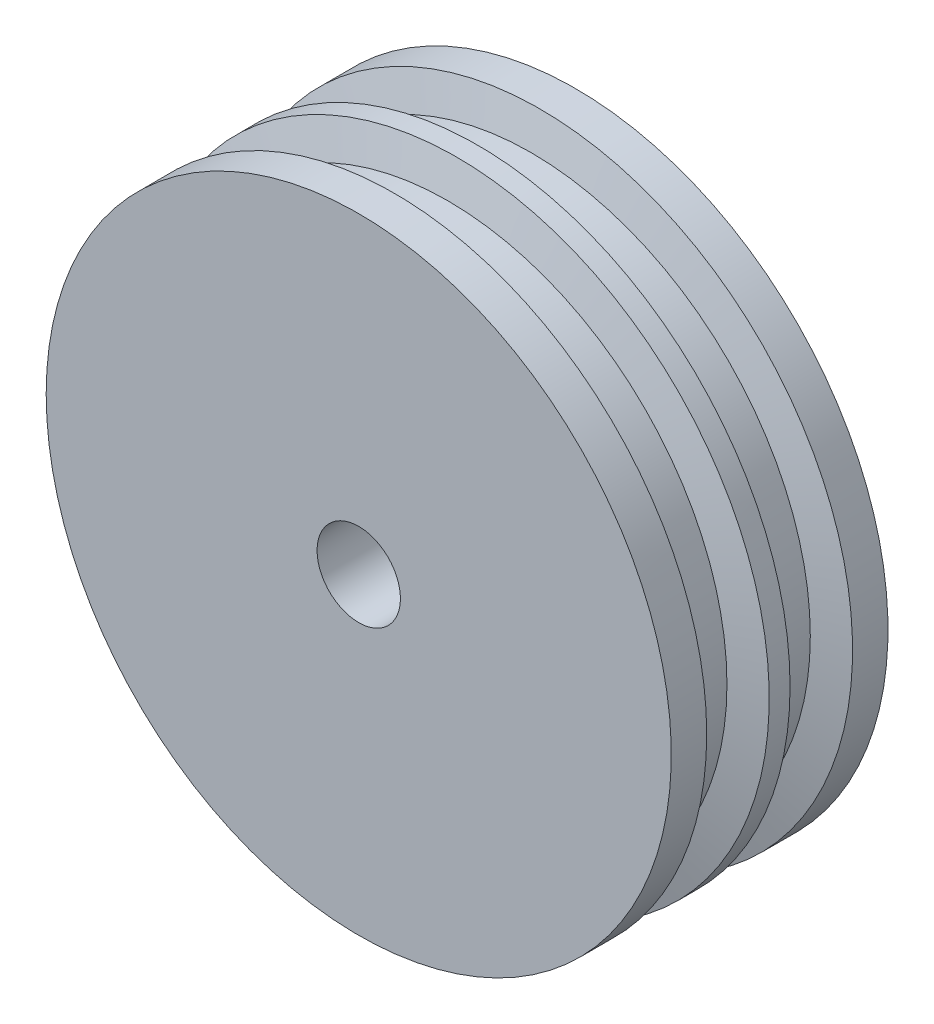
ISO-10303-21;
HEADER;
FILE_DESCRIPTION(('STEP AP214'),'2;1');
FILE_NAME('part.step','',(''),(''),'','','');
FILE_SCHEMA(('AUTOMOTIVE_DESIGN { 1 0 10303 214 1 1 1 1 }'));
ENDSEC;
DATA;
#1=APPLICATION_CONTEXT('core data for automotive mechanical design processes');
#2=APPLICATION_PROTOCOL_DEFINITION('international standard','automotive_design',2000,#1);
#3=PRODUCT_CONTEXT('',#1,'mechanical');
#4=PRODUCT('Part','Part','',(#3));
#5=PRODUCT_RELATED_PRODUCT_CATEGORY('part','',(#4));
#6=PRODUCT_DEFINITION_FORMATION('','',#4);
#7=PRODUCT_DEFINITION_CONTEXT('part definition',#1,'design');
#8=PRODUCT_DEFINITION('design','',#6,#7);
#9=PRODUCT_DEFINITION_SHAPE('','',#8);
#10=(LENGTH_UNIT() NAMED_UNIT(*) SI_UNIT(.MILLI.,.METRE.));
#11=(NAMED_UNIT(*) PLANE_ANGLE_UNIT() SI_UNIT($,.RADIAN.));
#12=(NAMED_UNIT(*) SI_UNIT($,.STERADIAN.) SOLID_ANGLE_UNIT());
#13=UNCERTAINTY_MEASURE_WITH_UNIT(LENGTH_MEASURE(1.E-05),#10,'distance_accuracy_value','');
#14=(GEOMETRIC_REPRESENTATION_CONTEXT(3) GLOBAL_UNCERTAINTY_ASSIGNED_CONTEXT((#13)) GLOBAL_UNIT_ASSIGNED_CONTEXT((#10,
#11,#12)) REPRESENTATION_CONTEXT('',''));
#15=CARTESIAN_POINT('',(0.,0.,0.));
#16=DIRECTION('',(0.,0.,1.));
#17=DIRECTION('',(1.,0.,0.));
#18=AXIS2_PLACEMENT_3D('',#15,#16,#17);
#19=CARTESIAN_POINT('',(0.,0.,26.));
#20=DIRECTION('',(0.,0.,-1.));
#21=DIRECTION('',(-1.,0.,0.));
#22=AXIS2_PLACEMENT_3D('',#19,#20,#21);
#23=CYLINDRICAL_SURFACE('',#22,75.);
#24=CARTESIAN_POINT('',(0.,0.,2.5));
#25=DIRECTION('',(0.,0.,1.));
#26=DIRECTION('',(1.,0.,0.));
#27=AXIS2_PLACEMENT_3D('',#24,#25,#26);
#28=CIRCLE('',#27,75.);
#29=CARTESIAN_POINT('',(-75.,0.,2.5));
#30=VERTEX_POINT('',#29);
#31=EDGE_CURVE('E47',#30,#30,#28,.T.);
#32=CARTESIAN_POINT('',(0.,0.,-2.49999999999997));
#33=DIRECTION('',(0.,0.,1.));
#34=DIRECTION('',(1.,0.,0.));
#35=AXIS2_PLACEMENT_3D('',#32,#33,#34);
#36=CIRCLE('',#35,75.);
#37=CARTESIAN_POINT('',(-75.,0.,-2.49999999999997));
#38=VERTEX_POINT('',#37);
#39=EDGE_CURVE('E56',#38,#38,#36,.T.);
#40=CARTESIAN_POINT('',(-75.,0.,2.5));
#41=CARTESIAN_POINT('',(-75.,0.,2.44791666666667));
#42=CARTESIAN_POINT('',(-75.,0.,2.39583333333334));
#43=CARTESIAN_POINT('',(-75.,0.,2.29166666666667));
#44=CARTESIAN_POINT('',(-75.,0.,2.23958333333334));
#45=CARTESIAN_POINT('',(-75.,0.,2.13541666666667));
#46=CARTESIAN_POINT('',(-75.,0.,2.08333333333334));
#47=CARTESIAN_POINT('',(-75.,0.,1.97916666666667));
#48=CARTESIAN_POINT('',(-75.,0.,1.92708333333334));
#49=CARTESIAN_POINT('',(-75.,0.,1.82291666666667));
#50=CARTESIAN_POINT('',(-75.,0.,1.77083333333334));
#51=CARTESIAN_POINT('',(-75.,0.,1.66666666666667));
#52=CARTESIAN_POINT('',(-75.,0.,1.61458333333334));
#53=CARTESIAN_POINT('',(-75.,0.,1.51041666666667));
#54=CARTESIAN_POINT('',(-75.,0.,1.45833333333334));
#55=CARTESIAN_POINT('',(-75.,0.,1.35416666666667));
#56=CARTESIAN_POINT('',(-75.,0.,1.30208333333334));
#57=CARTESIAN_POINT('',(-75.,0.,1.19791666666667));
#58=CARTESIAN_POINT('',(-75.,0.,1.14583333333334));
#59=CARTESIAN_POINT('',(-75.,0.,1.04166666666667));
#60=CARTESIAN_POINT('',(-75.,0.,0.989583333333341));
#61=CARTESIAN_POINT('',(-75.,0.,0.885416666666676));
#62=CARTESIAN_POINT('',(-75.,0.,0.833333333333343));
#63=CARTESIAN_POINT('',(-75.,0.,0.729166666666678));
#64=CARTESIAN_POINT('',(-75.,0.,0.677083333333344));
#65=CARTESIAN_POINT('',(-75.,0.,0.572916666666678));
#66=CARTESIAN_POINT('',(-75.,0.,0.520833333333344));
#67=CARTESIAN_POINT('',(-75.,0.,0.416666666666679));
#68=CARTESIAN_POINT('',(-75.,0.,0.364583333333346));
#69=CARTESIAN_POINT('',(-75.,0.,0.260416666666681));
#70=CARTESIAN_POINT('',(-75.,0.,0.208333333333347));
#71=CARTESIAN_POINT('',(-75.,0.,0.104166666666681));
#72=CARTESIAN_POINT('',(-75.,0.,0.0520833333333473));
#73=CARTESIAN_POINT('',(-75.,0.,-0.0520833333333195));
#74=CARTESIAN_POINT('',(-75.,0.,-0.104166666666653));
#75=CARTESIAN_POINT('',(-75.,0.,-0.20833333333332));
#76=CARTESIAN_POINT('',(-75.,0.,-0.260416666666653));
#77=CARTESIAN_POINT('',(-75.,0.,-0.364583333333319));
#78=CARTESIAN_POINT('',(-75.,0.,-0.416666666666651));
#79=CARTESIAN_POINT('',(-75.,0.,-0.520833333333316));
#80=CARTESIAN_POINT('',(-75.,0.,-0.57291666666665));
#81=CARTESIAN_POINT('',(-75.,0.,-0.677083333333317));
#82=CARTESIAN_POINT('',(-75.,0.,-0.72916666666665));
#83=CARTESIAN_POINT('',(-75.,0.,-0.833333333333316));
#84=CARTESIAN_POINT('',(-75.,0.,-0.885416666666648));
#85=CARTESIAN_POINT('',(-75.,0.,-0.989583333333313));
#86=CARTESIAN_POINT('',(-75.,0.,-1.04166666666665));
#87=CARTESIAN_POINT('',(-75.,0.,-1.14583333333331));
#88=CARTESIAN_POINT('',(-75.,0.,-1.19791666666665));
#89=CARTESIAN_POINT('',(-75.,0.,-1.30208333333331));
#90=CARTESIAN_POINT('',(-75.,0.,-1.35416666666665));
#91=CARTESIAN_POINT('',(-75.,0.,-1.45833333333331));
#92=CARTESIAN_POINT('',(-75.,0.,-1.51041666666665));
#93=CARTESIAN_POINT('',(-75.,0.,-1.61458333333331));
#94=CARTESIAN_POINT('',(-75.,0.,-1.66666666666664));
#95=CARTESIAN_POINT('',(-75.,0.,-1.77083333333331));
#96=CARTESIAN_POINT('',(-75.,0.,-1.82291666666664));
#97=CARTESIAN_POINT('',(-75.,0.,-1.92708333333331));
#98=CARTESIAN_POINT('',(-75.,0.,-1.97916666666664));
#99=CARTESIAN_POINT('',(-75.,0.,-2.08333333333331));
#100=CARTESIAN_POINT('',(-75.,0.,-2.13541666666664));
#101=CARTESIAN_POINT('',(-75.,0.,-2.23958333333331));
#102=CARTESIAN_POINT('',(-75.,0.,-2.29166666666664));
#103=CARTESIAN_POINT('',(-75.,0.,-2.39583333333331));
#104=CARTESIAN_POINT('',(-75.,0.,-2.44791666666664));
#105=CARTESIAN_POINT('',(-75.,0.,-2.49999999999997));
#106=B_SPLINE_CURVE_WITH_KNOTS('',3,(#40,#41,#42,#43,#44,#45,#46,#47,#48,#49,#50,#51,#52,#53,
#54,#55,#56,#57,#58,#59,#60,#61,#62,#63,#64,#65,#66,#67,#68,#69,#70,#71,#72,#73,#74,#75,#76,#77,
#78,#79,#80,#81,#82,#83,#84,#85,#86,#87,#88,#89,#90,#91,#92,#93,#94,#95,#96,#97,#98,#99,#100,
#101,#102,#103,#104,#105),.UNSPECIFIED.,.F.,.F.,(4,2,2,2,2,2,2,2,2,2,2,2,2,2,2,2,2,2,2,2,2,2,2,
2,2,2,2,2,2,2,2,2,4),(0.,0.15625,0.3125,0.468749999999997,0.624999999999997,0.781249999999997,
0.937499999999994,1.09374999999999,1.24999999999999,1.40624999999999,1.56249999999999,
1.71874999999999,1.87499999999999,2.03124999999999,2.18749999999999,2.34374999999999,
2.49999999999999,2.65624999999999,2.81249999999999,2.96874999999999,3.12499999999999,
3.28124999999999,3.43749999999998,3.59374999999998,3.74999999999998,3.90624999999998,
4.06249999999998,4.21874999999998,4.37499999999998,4.53124999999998,4.68749999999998,
4.84374999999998,4.99999999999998),.UNSPECIFIED.);
#107=EDGE_CURVE('BSEAM24',#30,#38,#106,.T.);
#108=ORIENTED_EDGE('',*,*,#31,.F.);
#109=ORIENTED_EDGE('',*,*,#39,.T.);
#110=ORIENTED_EDGE('',*,*,#107,.T.);
#111=ORIENTED_EDGE('',*,*,#107,.F.);
#112=EDGE_LOOP('',(#108,#110,#109,#111));
#113=FACE_BOUND('',#112,.T.);
#114=ADVANCED_FACE('F24',(#113),#23,.T.);
#115=CARTESIAN_POINT('',(0.,0.,-26.));
#116=DIRECTION('',(0.,0.,1.));
#117=DIRECTION('',(1.,0.,0.));
#118=AXIS2_PLACEMENT_3D('',#115,#116,#117);
#119=CIRCLE('',#118,75.);
#120=CARTESIAN_POINT('',(-75.,0.,-26.));
#121=VERTEX_POINT('',#120);
#122=EDGE_CURVE('E31',#121,#121,#119,.T.);
#123=CARTESIAN_POINT('',(0.,0.,-17.5));
#124=DIRECTION('',(0.,0.,1.));
#125=DIRECTION('',(1.,0.,0.));
#126=AXIS2_PLACEMENT_3D('',#123,#124,#125);
#127=CIRCLE('',#126,75.);
#128=CARTESIAN_POINT('',(-75.,0.,-17.5));
#129=VERTEX_POINT('',#128);
#130=EDGE_CURVE('E59',#129,#129,#127,.T.);
#131=CARTESIAN_POINT('',(-75.,0.,-26.));
#132=CARTESIAN_POINT('',(-75.,0.,-25.9114583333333));
#133=CARTESIAN_POINT('',(-75.,0.,-25.8229166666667));
#134=CARTESIAN_POINT('',(-75.,0.,-25.6458333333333));
#135=CARTESIAN_POINT('',(-75.,0.,-25.5572916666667));
#136=CARTESIAN_POINT('',(-75.,0.,-25.3802083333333));
#137=CARTESIAN_POINT('',(-75.,0.,-25.2916666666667));
#138=CARTESIAN_POINT('',(-75.,0.,-25.1145833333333));
#139=CARTESIAN_POINT('',(-75.,0.,-25.0260416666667));
#140=CARTESIAN_POINT('',(-75.,0.,-24.8489583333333));
#141=CARTESIAN_POINT('',(-75.,0.,-24.7604166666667));
#142=CARTESIAN_POINT('',(-75.,0.,-24.5833333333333));
#143=CARTESIAN_POINT('',(-75.,0.,-24.4947916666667));
#144=CARTESIAN_POINT('',(-75.,0.,-24.3177083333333));
#145=CARTESIAN_POINT('',(-75.,0.,-24.2291666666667));
#146=CARTESIAN_POINT('',(-75.,0.,-24.0520833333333));
#147=CARTESIAN_POINT('',(-75.,0.,-23.9635416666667));
#148=CARTESIAN_POINT('',(-75.,0.,-23.7864583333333));
#149=CARTESIAN_POINT('',(-75.,0.,-23.6979166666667));
#150=CARTESIAN_POINT('',(-75.,0.,-23.5208333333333));
#151=CARTESIAN_POINT('',(-75.,0.,-23.4322916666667));
#152=CARTESIAN_POINT('',(-75.,0.,-23.2552083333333));
#153=CARTESIAN_POINT('',(-75.,0.,-23.1666666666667));
#154=CARTESIAN_POINT('',(-75.,0.,-22.9895833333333));
#155=CARTESIAN_POINT('',(-75.,0.,-22.9010416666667));
#156=CARTESIAN_POINT('',(-75.,0.,-22.7239583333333));
#157=CARTESIAN_POINT('',(-75.,0.,-22.6354166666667));
#158=CARTESIAN_POINT('',(-75.,0.,-22.4583333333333));
#159=CARTESIAN_POINT('',(-75.,0.,-22.3697916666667));
#160=CARTESIAN_POINT('',(-75.,0.,-22.1927083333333));
#161=CARTESIAN_POINT('',(-75.,0.,-22.1041666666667));
#162=CARTESIAN_POINT('',(-75.,0.,-21.9270833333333));
#163=CARTESIAN_POINT('',(-75.,0.,-21.8385416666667));
#164=CARTESIAN_POINT('',(-75.,0.,-21.6614583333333));
#165=CARTESIAN_POINT('',(-75.,0.,-21.5729166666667));
#166=CARTESIAN_POINT('',(-75.,0.,-21.3958333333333));
#167=CARTESIAN_POINT('',(-75.,0.,-21.3072916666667));
#168=CARTESIAN_POINT('',(-75.,0.,-21.1302083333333));
#169=CARTESIAN_POINT('',(-75.,0.,-21.0416666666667));
#170=CARTESIAN_POINT('',(-75.,0.,-20.8645833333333));
#171=CARTESIAN_POINT('',(-75.,0.,-20.7760416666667));
#172=CARTESIAN_POINT('',(-75.,0.,-20.5989583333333));
#173=CARTESIAN_POINT('',(-75.,0.,-20.5104166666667));
#174=CARTESIAN_POINT('',(-75.,0.,-20.3333333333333));
#175=CARTESIAN_POINT('',(-75.,0.,-20.2447916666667));
#176=CARTESIAN_POINT('',(-75.,0.,-20.0677083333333));
#177=CARTESIAN_POINT('',(-75.,0.,-19.9791666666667));
#178=CARTESIAN_POINT('',(-75.,0.,-19.8020833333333));
#179=CARTESIAN_POINT('',(-75.,0.,-19.7135416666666));
#180=CARTESIAN_POINT('',(-75.,0.,-19.5364583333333));
#181=CARTESIAN_POINT('',(-75.,0.,-19.4479166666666));
#182=CARTESIAN_POINT('',(-75.,0.,-19.2708333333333));
#183=CARTESIAN_POINT('',(-75.,0.,-19.1822916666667));
#184=CARTESIAN_POINT('',(-75.,0.,-19.0052083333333));
#185=CARTESIAN_POINT('',(-75.,0.,-18.9166666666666));
#186=CARTESIAN_POINT('',(-75.,0.,-18.7395833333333));
#187=CARTESIAN_POINT('',(-75.,0.,-18.6510416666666));
#188=CARTESIAN_POINT('',(-75.,0.,-18.4739583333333));
#189=CARTESIAN_POINT('',(-75.,0.,-18.3854166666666));
#190=CARTESIAN_POINT('',(-75.,0.,-18.2083333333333));
#191=CARTESIAN_POINT('',(-75.,0.,-18.1197916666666));
#192=CARTESIAN_POINT('',(-75.,0.,-17.9427083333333));
#193=CARTESIAN_POINT('',(-75.,0.,-17.8541666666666));
#194=CARTESIAN_POINT('',(-75.,0.,-17.6770833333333));
#195=CARTESIAN_POINT('',(-75.,0.,-17.5885416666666));
#196=CARTESIAN_POINT('',(-75.,0.,-17.5));
#197=B_SPLINE_CURVE_WITH_KNOTS('',3,(#131,#132,#133,#134,#135,#136,#137,#138,#139,#140,#141,
#142,#143,#144,#145,#146,#147,#148,#149,#150,#151,#152,#153,#154,#155,#156,#157,#158,#159,#160,
#161,#162,#163,#164,#165,#166,#167,#168,#169,#170,#171,#172,#173,#174,#175,#176,#177,#178,#179,
#180,#181,#182,#183,#184,#185,#186,#187,#188,#189,#190,#191,#192,#193,#194,#195,#196),
.UNSPECIFIED.,.F.,.F.,(4,2,2,2,2,2,2,2,2,2,2,2,2,2,2,2,2,2,2,2,2,2,2,2,2,2,2,2,2,2,2,2,4),(0.,
0.265624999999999,0.531250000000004,0.796875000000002,1.0625,1.32812500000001,1.59375,1.859375,
2.125,2.39062500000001,2.65625000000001,2.921875,3.18750000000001,3.45312500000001,
3.71875000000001,3.98437500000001,4.25000000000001,4.51562500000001,4.78125000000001,
5.04687500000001,5.31250000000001,5.57812500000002,5.84375000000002,6.10937500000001,
6.37500000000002,6.64062500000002,6.90625000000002,7.17187500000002,7.43750000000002,
7.70312500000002,7.96875000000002,8.23437500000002,8.50000000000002),.UNSPECIFIED.);
#198=EDGE_CURVE('BSEAM83',#121,#129,#197,.T.);
#199=ORIENTED_EDGE('',*,*,#122,.T.);
#200=ORIENTED_EDGE('',*,*,#130,.F.);
#201=ORIENTED_EDGE('',*,*,#198,.T.);
#202=ORIENTED_EDGE('',*,*,#198,.F.);
#203=EDGE_LOOP('',(#199,#201,#200,#202));
#204=FACE_BOUND('',#203,.T.);
#205=ADVANCED_FACE('F83',(#204),#23,.T.);
#206=CARTESIAN_POINT('',(0.,0.,26.));
#207=DIRECTION('',(0.,0.,1.));
#208=DIRECTION('',(1.,0.,0.));
#209=AXIS2_PLACEMENT_3D('',#206,#207,#208);
#210=CIRCLE('',#209,75.);
#211=CARTESIAN_POINT('',(-75.,0.,26.));
#212=VERTEX_POINT('',#211);
#213=EDGE_CURVE('E10',#212,#212,#210,.T.);
#214=CARTESIAN_POINT('',(0.,0.,17.5));
#215=DIRECTION('',(0.,0.,1.));
#216=DIRECTION('',(1.,0.,0.));
#217=AXIS2_PLACEMENT_3D('',#214,#215,#216);
#218=CIRCLE('',#217,75.);
#219=CARTESIAN_POINT('',(-75.,0.,17.5));
#220=VERTEX_POINT('',#219);
#221=EDGE_CURVE('E44',#220,#220,#218,.T.);
#222=CARTESIAN_POINT('',(-75.,0.,26.));
#223=CARTESIAN_POINT('',(-75.,0.,25.9114583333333));
#224=CARTESIAN_POINT('',(-75.,0.,25.8229166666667));
#225=CARTESIAN_POINT('',(-75.,0.,25.6458333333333));
#226=CARTESIAN_POINT('',(-75.,0.,25.5572916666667));
#227=CARTESIAN_POINT('',(-75.,0.,25.3802083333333));
#228=CARTESIAN_POINT('',(-75.,0.,25.2916666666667));
#229=CARTESIAN_POINT('',(-75.,0.,25.1145833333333));
#230=CARTESIAN_POINT('',(-75.,0.,25.0260416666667));
#231=CARTESIAN_POINT('',(-75.,0.,24.8489583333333));
#232=CARTESIAN_POINT('',(-75.,0.,24.7604166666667));
#233=CARTESIAN_POINT('',(-75.,0.,24.5833333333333));
#234=CARTESIAN_POINT('',(-75.,0.,24.4947916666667));
#235=CARTESIAN_POINT('',(-75.,0.,24.3177083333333));
#236=CARTESIAN_POINT('',(-75.,0.,24.2291666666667));
#237=CARTESIAN_POINT('',(-75.,0.,24.0520833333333));
#238=CARTESIAN_POINT('',(-75.,0.,23.9635416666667));
#239=CARTESIAN_POINT('',(-75.,0.,23.7864583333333));
#240=CARTESIAN_POINT('',(-75.,0.,23.6979166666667));
#241=CARTESIAN_POINT('',(-75.,0.,23.5208333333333));
#242=CARTESIAN_POINT('',(-75.,0.,23.4322916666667));
#243=CARTESIAN_POINT('',(-75.,0.,23.2552083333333));
#244=CARTESIAN_POINT('',(-75.,0.,23.1666666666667));
#245=CARTESIAN_POINT('',(-75.,0.,22.9895833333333));
#246=CARTESIAN_POINT('',(-75.,0.,22.9010416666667));
#247=CARTESIAN_POINT('',(-75.,0.,22.7239583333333));
#248=CARTESIAN_POINT('',(-75.,0.,22.6354166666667));
#249=CARTESIAN_POINT('',(-75.,0.,22.4583333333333));
#250=CARTESIAN_POINT('',(-75.,0.,22.3697916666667));
#251=CARTESIAN_POINT('',(-75.,0.,22.1927083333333));
#252=CARTESIAN_POINT('',(-75.,0.,22.1041666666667));
#253=CARTESIAN_POINT('',(-75.,0.,21.9270833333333));
#254=CARTESIAN_POINT('',(-75.,0.,21.8385416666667));
#255=CARTESIAN_POINT('',(-75.,0.,21.6614583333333));
#256=CARTESIAN_POINT('',(-75.,0.,21.5729166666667));
#257=CARTESIAN_POINT('',(-75.,0.,21.3958333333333));
#258=CARTESIAN_POINT('',(-75.,0.,21.3072916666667));
#259=CARTESIAN_POINT('',(-75.,0.,21.1302083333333));
#260=CARTESIAN_POINT('',(-75.,0.,21.0416666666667));
#261=CARTESIAN_POINT('',(-75.,0.,20.8645833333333));
#262=CARTESIAN_POINT('',(-75.,0.,20.7760416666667));
#263=CARTESIAN_POINT('',(-75.,0.,20.5989583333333));
#264=CARTESIAN_POINT('',(-75.,0.,20.5104166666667));
#265=CARTESIAN_POINT('',(-75.,0.,20.3333333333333));
#266=CARTESIAN_POINT('',(-75.,0.,20.2447916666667));
#267=CARTESIAN_POINT('',(-75.,0.,20.0677083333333));
#268=CARTESIAN_POINT('',(-75.,0.,19.9791666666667));
#269=CARTESIAN_POINT('',(-75.,0.,19.8020833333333));
#270=CARTESIAN_POINT('',(-75.,0.,19.7135416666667));
#271=CARTESIAN_POINT('',(-75.,0.,19.5364583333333));
#272=CARTESIAN_POINT('',(-75.,0.,19.4479166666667));
#273=CARTESIAN_POINT('',(-75.,0.,19.2708333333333));
#274=CARTESIAN_POINT('',(-75.,0.,19.1822916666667));
#275=CARTESIAN_POINT('',(-75.,0.,19.0052083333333));
#276=CARTESIAN_POINT('',(-75.,0.,18.9166666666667));
#277=CARTESIAN_POINT('',(-75.,0.,18.7395833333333));
#278=CARTESIAN_POINT('',(-75.,0.,18.6510416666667));
#279=CARTESIAN_POINT('',(-75.,0.,18.4739583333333));
#280=CARTESIAN_POINT('',(-75.,0.,18.3854166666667));
#281=CARTESIAN_POINT('',(-75.,0.,18.2083333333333));
#282=CARTESIAN_POINT('',(-75.,0.,18.1197916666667));
#283=CARTESIAN_POINT('',(-75.,0.,17.9427083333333));
#284=CARTESIAN_POINT('',(-75.,0.,17.8541666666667));
#285=CARTESIAN_POINT('',(-75.,0.,17.6770833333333));
#286=CARTESIAN_POINT('',(-75.,0.,17.5885416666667));
#287=CARTESIAN_POINT('',(-75.,0.,17.5));
#288=B_SPLINE_CURVE_WITH_KNOTS('',3,(#222,#223,#224,#225,#226,#227,#228,#229,#230,#231,#232,
#233,#234,#235,#236,#237,#238,#239,#240,#241,#242,#243,#244,#245,#246,#247,#248,#249,#250,#251,
#252,#253,#254,#255,#256,#257,#258,#259,#260,#261,#262,#263,#264,#265,#266,#267,#268,#269,#270,
#271,#272,#273,#274,#275,#276,#277,#278,#279,#280,#281,#282,#283,#284,#285,#286,#287),
.UNSPECIFIED.,.F.,.F.,(4,2,2,2,2,2,2,2,2,2,2,2,2,2,2,2,2,2,2,2,2,2,2,2,2,2,2,2,2,2,2,2,4),(0.,
0.265625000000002,0.53125,0.796875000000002,1.0625,1.328125,1.59375,1.859375,2.125,2.390625,
2.65625,2.921875,3.1875,3.453125,3.71875,3.984375,4.25,4.515625,4.78125,5.046875,5.3125,
5.578125,5.84375,6.109375,6.375,6.640625,6.90625,7.171875,7.4375,7.703125,7.96875,8.234375,8.5),.UNSPECIFIED.);
#289=EDGE_CURVE('BSEAM26',#212,#220,#288,.T.);
#290=ORIENTED_EDGE('',*,*,#213,.F.);
#291=ORIENTED_EDGE('',*,*,#221,.T.);
#292=ORIENTED_EDGE('',*,*,#289,.T.);
#293=ORIENTED_EDGE('',*,*,#289,.F.);
#294=EDGE_LOOP('',(#290,#292,#291,#293));
#295=FACE_BOUND('',#294,.T.);
#296=ADVANCED_FACE('F26',(#295),#23,.T.);
#297=CARTESIAN_POINT('',(0.,0.,26.));
#298=DIRECTION('',(0.,0.,1.));
#299=DIRECTION('',(1.,0.,0.));
#300=AXIS2_PLACEMENT_3D('',#297,#298,#299);
#301=PLANE('',#300);
#302=ORIENTED_EDGE('',*,*,#213,.T.);
#303=EDGE_LOOP('',(#302));
#304=FACE_BOUND('',#303,.T.);
#305=CARTESIAN_POINT('',(0.,0.,26.));
#306=DIRECTION('',(0.,0.,1.));
#307=DIRECTION('',(1.,0.,0.));
#308=AXIS2_PLACEMENT_3D('',#305,#306,#307);
#309=CIRCLE('',#308,10.);
#310=CARTESIAN_POINT('',(-10.,0.,26.));
#311=VERTEX_POINT('',#310);
#312=EDGE_CURVE('E35',#311,#311,#309,.T.);
#313=ORIENTED_EDGE('',*,*,#312,.F.);
#314=EDGE_LOOP('',(#313));
#315=FACE_BOUND('',#314,.T.);
#316=ADVANCED_FACE('F92',(#304,#315),#301,.T.);
#317=CARTESIAN_POINT('',(0.,0.,-26.));
#318=DIRECTION('',(0.,0.,1.));
#319=DIRECTION('',(1.,0.,0.));
#320=AXIS2_PLACEMENT_3D('',#317,#318,#319);
#321=PLANE('',#320);
#322=ORIENTED_EDGE('',*,*,#122,.F.);
#323=EDGE_LOOP('',(#322));
#324=FACE_BOUND('',#323,.T.);
#325=CARTESIAN_POINT('',(0.,0.,-26.));
#326=DIRECTION('',(0.,0.,1.));
#327=DIRECTION('',(1.,0.,0.));
#328=AXIS2_PLACEMENT_3D('',#325,#326,#327);
#329=CIRCLE('',#328,10.);
#330=CARTESIAN_POINT('',(-10.,0.,-26.));
#331=VERTEX_POINT('',#330);
#332=EDGE_CURVE('E39',#331,#331,#329,.T.);
#333=ORIENTED_EDGE('',*,*,#332,.T.);
#334=EDGE_LOOP('',(#333));
#335=FACE_BOUND('',#334,.T.);
#336=ADVANCED_FACE('F99',(#324,#335),#321,.F.);
#337=CARTESIAN_POINT('',(0.,0.,26.));
#338=DIRECTION('',(0.,0.,-1.));
#339=DIRECTION('',(-1.,0.,0.));
#340=AXIS2_PLACEMENT_3D('',#337,#338,#339);
#341=CYLINDRICAL_SURFACE('',#340,10.);
#342=CARTESIAN_POINT('',(-10.,0.,26.));
#343=CARTESIAN_POINT('',(-10.,0.,25.4583333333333));
#344=CARTESIAN_POINT('',(-10.,0.,24.9166666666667));
#345=CARTESIAN_POINT('',(-10.,0.,23.8333333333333));
#346=CARTESIAN_POINT('',(-10.,0.,23.2916666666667));
#347=CARTESIAN_POINT('',(-10.,0.,22.2083333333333));
#348=CARTESIAN_POINT('',(-10.,0.,21.6666666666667));
#349=CARTESIAN_POINT('',(-10.,0.,20.5833333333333));
#350=CARTESIAN_POINT('',(-10.,0.,20.0416666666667));
#351=CARTESIAN_POINT('',(-10.,0.,18.9583333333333));
#352=CARTESIAN_POINT('',(-10.,0.,18.4166666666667));
#353=CARTESIAN_POINT('',(-10.,0.,17.3333333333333));
#354=CARTESIAN_POINT('',(-10.,0.,16.7916666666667));
#355=CARTESIAN_POINT('',(-10.,0.,15.7083333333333));
#356=CARTESIAN_POINT('',(-10.,0.,15.1666666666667));
#357=CARTESIAN_POINT('',(-10.,0.,14.0833333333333));
#358=CARTESIAN_POINT('',(-10.,0.,13.5416666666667));
#359=CARTESIAN_POINT('',(-10.,0.,12.4583333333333));
#360=CARTESIAN_POINT('',(-10.,0.,11.9166666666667));
#361=CARTESIAN_POINT('',(-10.,0.,10.8333333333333));
#362=CARTESIAN_POINT('',(-10.,0.,10.2916666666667));
#363=CARTESIAN_POINT('',(-10.,0.,9.20833333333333));
#364=CARTESIAN_POINT('',(-10.,0.,8.66666666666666));
#365=CARTESIAN_POINT('',(-10.,0.,7.58333333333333));
#366=CARTESIAN_POINT('',(-10.,0.,7.04166666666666));
#367=CARTESIAN_POINT('',(-10.,0.,5.95833333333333));
#368=CARTESIAN_POINT('',(-10.,0.,5.41666666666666));
#369=CARTESIAN_POINT('',(-10.,0.,4.33333333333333));
#370=CARTESIAN_POINT('',(-10.,0.,3.79166666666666));
#371=CARTESIAN_POINT('',(-10.,0.,2.70833333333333));
#372=CARTESIAN_POINT('',(-10.,0.,2.16666666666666));
#373=CARTESIAN_POINT('',(-10.,0.,1.08333333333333));
#374=CARTESIAN_POINT('',(-10.,0.,0.541666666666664));
#375=CARTESIAN_POINT('',(-10.,0.,-0.54166666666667));
#376=CARTESIAN_POINT('',(-10.,0.,-1.08333333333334));
#377=CARTESIAN_POINT('',(-10.,0.,-2.16666666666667));
#378=CARTESIAN_POINT('',(-10.,0.,-2.70833333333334));
#379=CARTESIAN_POINT('',(-10.,0.,-3.79166666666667));
#380=CARTESIAN_POINT('',(-10.,0.,-4.33333333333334));
#381=CARTESIAN_POINT('',(-10.,0.,-5.41666666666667));
#382=CARTESIAN_POINT('',(-10.,0.,-5.95833333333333));
#383=CARTESIAN_POINT('',(-10.,0.,-7.04166666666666));
#384=CARTESIAN_POINT('',(-10.,0.,-7.58333333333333));
#385=CARTESIAN_POINT('',(-10.,0.,-8.66666666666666));
#386=CARTESIAN_POINT('',(-10.,0.,-9.20833333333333));
#387=CARTESIAN_POINT('',(-10.,0.,-10.2916666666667));
#388=CARTESIAN_POINT('',(-10.,0.,-10.8333333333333));
#389=CARTESIAN_POINT('',(-10.,0.,-11.9166666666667));
#390=CARTESIAN_POINT('',(-10.,0.,-12.4583333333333));
#391=CARTESIAN_POINT('',(-10.,0.,-13.5416666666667));
#392=CARTESIAN_POINT('',(-10.,0.,-14.0833333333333));
#393=CARTESIAN_POINT('',(-10.,0.,-15.1666666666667));
#394=CARTESIAN_POINT('',(-10.,0.,-15.7083333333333));
#395=CARTESIAN_POINT('',(-10.,0.,-16.7916666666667));
#396=CARTESIAN_POINT('',(-10.,0.,-17.3333333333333));
#397=CARTESIAN_POINT('',(-10.,0.,-18.4166666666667));
#398=CARTESIAN_POINT('',(-10.,0.,-18.9583333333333));
#399=CARTESIAN_POINT('',(-10.,0.,-20.0416666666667));
#400=CARTESIAN_POINT('',(-10.,0.,-20.5833333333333));
#401=CARTESIAN_POINT('',(-10.,0.,-21.6666666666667));
#402=CARTESIAN_POINT('',(-10.,0.,-22.2083333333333));
#403=CARTESIAN_POINT('',(-10.,0.,-23.2916666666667));
#404=CARTESIAN_POINT('',(-10.,0.,-23.8333333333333));
#405=CARTESIAN_POINT('',(-10.,0.,-24.9166666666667));
#406=CARTESIAN_POINT('',(-10.,0.,-25.4583333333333));
#407=CARTESIAN_POINT('',(-10.,0.,-26.));
#408=B_SPLINE_CURVE_WITH_KNOTS('',3,(#342,#343,#344,#345,#346,#347,#348,#349,#350,#351,#352,
#353,#354,#355,#356,#357,#358,#359,#360,#361,#362,#363,#364,#365,#366,#367,#368,#369,#370,#371,
#372,#373,#374,#375,#376,#377,#378,#379,#380,#381,#382,#383,#384,#385,#386,#387,#388,#389,#390,
#391,#392,#393,#394,#395,#396,#397,#398,#399,#400,#401,#402,#403,#404,#405,#406,#407),
.UNSPECIFIED.,.F.,.F.,(4,2,2,2,2,2,2,2,2,2,2,2,2,2,2,2,2,2,2,2,2,2,2,2,2,2,2,2,2,2,2,2,4),(0.,
1.625,3.25,4.875,6.5,8.125,9.75,11.375,13.,14.625,16.25,17.875,19.5,21.125,22.75,24.375,26.,
27.625,29.25,30.875,32.5,34.125,35.75,37.375,39.,40.625,42.25,43.875,45.5,47.125,48.75,50.375,
52.),.UNSPECIFIED.);
#409=EDGE_CURVE('BSEAM105',#311,#331,#408,.T.);
#410=ORIENTED_EDGE('',*,*,#312,.T.);
#411=ORIENTED_EDGE('',*,*,#332,.F.);
#412=ORIENTED_EDGE('',*,*,#409,.T.);
#413=ORIENTED_EDGE('',*,*,#409,.F.);
#414=EDGE_LOOP('',(#410,#412,#411,#413));
#415=FACE_BOUND('',#414,.T.);
#416=ADVANCED_FACE('F105',(#415),#341,.F.);
#417=CARTESIAN_POINT('',(0.,0.,17.5));
#418=DIRECTION('',(0.,0.,1.));
#419=DIRECTION('',(1.,0.,0.));
#420=AXIS2_PLACEMENT_3D('',#417,#418,#419);
#421=CONICAL_SURFACE('',#420,75.,1.30899693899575);
#422=CARTESIAN_POINT('',(0.,0.,15.356406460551));
#423=DIRECTION('',(0.,0.,1.));
#424=DIRECTION('',(1.,0.,0.));
#425=AXIS2_PLACEMENT_3D('',#422,#423,#424);
#426=CIRCLE('',#425,67.);
#427=CARTESIAN_POINT('',(67.,0.,15.356406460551));
#428=VERTEX_POINT('',#427);
#429=EDGE_CURVE('E53',#428,#428,#426,.T.);
#430=ORIENTED_EDGE('',*,*,#429,.T.);
#431=EDGE_LOOP('',(#430));
#432=FACE_BOUND('',#431,.T.);
#433=ORIENTED_EDGE('',*,*,#221,.F.);
#434=EDGE_LOOP('',(#433));
#435=FACE_BOUND('',#434,.T.);
#436=ADVANCED_FACE('F103',(#432,#435),#421,.T.);
#437=CARTESIAN_POINT('',(0.,0.,4.64359353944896));
#438=DIRECTION('',(0.,0.,-1.));
#439=DIRECTION('',(-1.,0.,0.));
#440=AXIS2_PLACEMENT_3D('',#437,#438,#439);
#441=CONICAL_SURFACE('',#440,67.,1.30899693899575);
#442=ORIENTED_EDGE('',*,*,#31,.T.);
#443=EDGE_LOOP('',(#442));
#444=FACE_BOUND('',#443,.T.);
#445=CARTESIAN_POINT('',(0.,0.,4.64359353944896));
#446=DIRECTION('',(0.,0.,1.));
#447=DIRECTION('',(1.,0.,0.));
#448=AXIS2_PLACEMENT_3D('',#445,#446,#447);
#449=CIRCLE('',#448,67.);
#450=CARTESIAN_POINT('',(67.,0.,4.64359353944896));
#451=VERTEX_POINT('',#450);
#452=EDGE_CURVE('E50',#451,#451,#449,.T.);
#453=ORIENTED_EDGE('',*,*,#452,.F.);
#454=EDGE_LOOP('',(#453));
#455=FACE_BOUND('',#454,.T.);
#456=ADVANCED_FACE('F104',(#444,#455),#441,.T.);
#457=CARTESIAN_POINT('',(0.,0.,0.));
#458=DIRECTION('',(0.,0.,1.));
#459=DIRECTION('',(1.,0.,0.));
#460=AXIS2_PLACEMENT_3D('',#457,#458,#459);
#461=CYLINDRICAL_SURFACE('',#460,67.);
#462=ORIENTED_EDGE('',*,*,#452,.T.);
#463=EDGE_LOOP('',(#462));
#464=FACE_BOUND('',#463,.T.);
#465=ORIENTED_EDGE('',*,*,#429,.F.);
#466=EDGE_LOOP('',(#465));
#467=FACE_BOUND('',#466,.T.);
#468=ADVANCED_FACE('F111',(#464,#467),#461,.T.);
#469=CARTESIAN_POINT('',(0.,0.,-2.49999999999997));
#470=DIRECTION('',(0.,0.,1.));
#471=DIRECTION('',(1.,0.,0.));
#472=AXIS2_PLACEMENT_3D('',#469,#470,#471);
#473=CONICAL_SURFACE('',#472,75.,1.30899693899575);
#474=CARTESIAN_POINT('',(0.,0.,-4.64359353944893));
#475=DIRECTION('',(0.,0.,1.));
#476=DIRECTION('',(1.,0.,0.));
#477=AXIS2_PLACEMENT_3D('',#474,#475,#476);
#478=CIRCLE('',#477,67.);
#479=CARTESIAN_POINT('',(67.,0.,-4.64359353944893));
#480=VERTEX_POINT('',#479);
#481=EDGE_CURVE('E65',#480,#480,#478,.T.);
#482=ORIENTED_EDGE('',*,*,#481,.T.);
#483=EDGE_LOOP('',(#482));
#484=FACE_BOUND('',#483,.T.);
#485=ORIENTED_EDGE('',*,*,#39,.F.);
#486=EDGE_LOOP('',(#485));
#487=FACE_BOUND('',#486,.T.);
#488=ADVANCED_FACE('F69',(#484,#487),#473,.T.);
#489=CARTESIAN_POINT('',(0.,0.,-15.356406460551));
#490=DIRECTION('',(0.,0.,-1.));
#491=DIRECTION('',(-1.,0.,0.));
#492=AXIS2_PLACEMENT_3D('',#489,#490,#491);
#493=CONICAL_SURFACE('',#492,67.,1.30899693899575);
#494=ORIENTED_EDGE('',*,*,#130,.T.);
#495=EDGE_LOOP('',(#494));
#496=FACE_BOUND('',#495,.T.);
#497=CARTESIAN_POINT('',(0.,0.,-15.356406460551));
#498=DIRECTION('',(0.,0.,1.));
#499=DIRECTION('',(1.,0.,0.));
#500=AXIS2_PLACEMENT_3D('',#497,#498,#499);
#501=CIRCLE('',#500,67.);
#502=CARTESIAN_POINT('',(67.,0.,-15.356406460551));
#503=VERTEX_POINT('',#502);
#504=EDGE_CURVE('E62',#503,#503,#501,.T.);
#505=ORIENTED_EDGE('',*,*,#504,.F.);
#506=EDGE_LOOP('',(#505));
#507=FACE_BOUND('',#506,.T.);
#508=ADVANCED_FACE('F74',(#496,#507),#493,.T.);
#509=CARTESIAN_POINT('',(0.,0.,-20.));
#510=DIRECTION('',(0.,0.,1.));
#511=DIRECTION('',(1.,0.,0.));
#512=AXIS2_PLACEMENT_3D('',#509,#510,#511);
#513=CYLINDRICAL_SURFACE('',#512,67.);
#514=ORIENTED_EDGE('',*,*,#504,.T.);
#515=EDGE_LOOP('',(#514));
#516=FACE_BOUND('',#515,.T.);
#517=ORIENTED_EDGE('',*,*,#481,.F.);
#518=EDGE_LOOP('',(#517));
#519=FACE_BOUND('',#518,.T.);
#520=ADVANCED_FACE('F72',(#516,#519),#513,.T.);
#521=CLOSED_SHELL('',(#114,#205,#296,#316,#336,#416,#436,#456,#468,#488,#508,#520));
#522=MANIFOLD_SOLID_BREP('B2',#521);
#523=ADVANCED_BREP_SHAPE_REPRESENTATION('',(#18,#522),#14);
#524=SHAPE_DEFINITION_REPRESENTATION(#9,#523);
ENDSEC;
END-ISO-10303-21;
